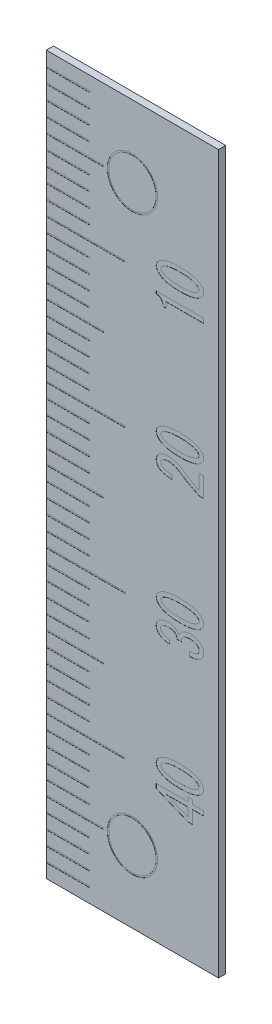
from build123d import *

# Parameters (mm, degrees)
SKETCH1_W      = 12
SKETCH1_H      = 50
EXTRUDE1_DEPTH = 0.5
SKETCH2_R      = 1.75
SKETCH2_R_2    = 1.65
EXTRUDE2_DEPTH = 0.01
EXTRUDE3_DEPTH = 0.01
SKETCH4_W      = 3
SKETCH4_H      = 0.1
SKETCH4_W_2    = 4
SKETCH4_W_3    = 5.5
EXTRUDE4_DEPTH = 0.01


with BuildPart() as part:
    # Sketch1 → Extrude1 (new body)
    with BuildSketch(Plane.XY):
        with Locations((6, 25)):
            Rectangle(SKETCH1_W, SKETCH1_H)
    extrude(amount=EXTRUDE1_DEPTH)

    # Sketch2 → Extrude2 (cut)
    # profile 1 of 2: a face of its own
    with BuildSketch(Plane.XY.offset(0.5)):
        with Locations((6, 5)):
            Circle(SKETCH2_R)
        with Locations((6, 5)):
            Circle(SKETCH2_R_2, mode=Mode.SUBTRACT)
    # profile 2 of 2: a face of its own
    with BuildSketch(Plane.XY.offset(0.5)):
        with Locations((6, 45)):
            Circle(SKETCH2_R)
        with Locations((6, 45)):
            Circle(SKETCH2_R_2, mode=Mode.SUBTRACT)
    extrude(amount=-EXTRUDE2_DEPTH, mode=Mode.SUBTRACT)

    # Sketch3 → Extrude3 (cut)
    # profile 1 of 8: a face of its own
    with BuildSketch(Plane.XY.offset(0.5)):
        with BuildLine():
            Line((10.964202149, 38.983541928), (9.643449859, 38.983541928))
            Line((9.643449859, 38.983541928), (8.334630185, 38.983541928))
            Line((8.334630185, 38.983541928), (8.334630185, 38.58788147))
            Line((8.334630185, 38.58788147), (8.134287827, 38.58788147))
            add(Edge.make_bspline(
                [(8.134287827, 38.58788147), (8.133949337, 38.607154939), (8.133292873, 38.644533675), (8.127537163, 38.699138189), (8.117992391, 38.750485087), (8.105914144, 38.79930573), (8.088535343, 38.844454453), (8.068559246, 38.887235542), (8.044100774, 38.926478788), (8.016032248, 38.962796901), (7.984633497, 38.996211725), (7.949221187, 39.026469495), (7.910057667, 39.053561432), (7.867120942, 39.077453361), (7.820438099, 39.09818504), (7.770182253, 39.115604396), (7.716225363, 39.130205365), (7.67880858, 39.137442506), (7.659495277, 39.141178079)],
                knots=[0, 0, 0, 0, 1.144858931, 2.220325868, 3.257124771, 4.246590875, 5.202985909, 6.126465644, 7.048017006, 7.94360395, 8.849836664, 9.767181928, 10.705616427, 11.674465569, 12.68221077, 13.736395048, 14.831602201, 16, 16, 16, 16], degree=3))
            Line((7.659495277, 39.141178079), (7.659495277, 39.303210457))
            Line((7.659495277, 39.303210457), (10.964202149, 39.303210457))
            Line((10.964202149, 39.303210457), (10.964202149, 38.983541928))
        make_face()
    # profile 2 of 8: a face of its own
    with BuildSketch(Plane.XY.offset(0.5)):
        with BuildLine():
            add(Edge.make_bspline(
                [(9.304312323, 40.08636695), (9.263487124, 40.086598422), (9.183284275, 40.087053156), (9.065184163, 40.090916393), (8.951677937, 40.097059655), (8.842790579, 40.105920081), (8.738418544, 40.116877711), (8.638826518, 40.131643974), (8.543659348, 40.147711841), (8.453367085, 40.166540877), (8.367534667, 40.187646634), (8.286660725, 40.212475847), (8.209981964, 40.238496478), (8.13792646, 40.267351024), (8.071052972, 40.299483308), (8.008231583, 40.333293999), (7.950513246, 40.370357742), (7.914537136, 40.397244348), (7.896891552, 40.410431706)],
                knots=[0, 0, 0, 0, 1.334199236, 2.621091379, 3.861325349, 5.048806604, 6.191184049, 7.29033474, 8.338632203, 9.344988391, 10.304094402, 11.226124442, 12.10888774, 12.949942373, 13.760906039, 14.53244093, 15.280190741, 16, 16, 16, 16], degree=3))
            add(Edge.make_bspline(
                [(7.896891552, 40.410431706), (7.877886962, 40.425936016), (7.841081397, 40.455962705), (7.793642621, 40.506288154), (7.75209867, 40.556343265), (7.718531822, 40.608467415), (7.691781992, 40.661574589), (7.673561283, 40.716630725), (7.661657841, 40.77250316), (7.660214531, 40.810429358), (7.659495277, 40.829329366)],
                knots=[0, 0, 0, 0, 1.179273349, 2.283859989, 3.322502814, 4.306324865, 5.261663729, 6.17616916, 7.091118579, 8, 8, 8, 8], degree=3))
            add(Edge.make_bspline(
                [(7.659495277, 40.829329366), (7.660212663, 40.848230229), (7.661652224, 40.886158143), (7.67358392, 40.942017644), (7.691636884, 40.996945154), (7.718688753, 41.049705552), (7.752296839, 41.101723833), (7.793217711, 41.152330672), (7.841340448, 41.202029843), (7.877935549, 41.232049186), (7.896891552, 41.247598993)],
                knots=[0, 0, 0, 0, 0.909839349, 1.825753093, 2.741222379, 3.688535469, 4.673394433, 5.720979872, 6.819483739, 8, 8, 8, 8], degree=3))
            add(Edge.make_bspline(
                [(7.896891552, 41.247598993), (7.914537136, 41.260786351), (7.950513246, 41.287672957), (8.008231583, 41.3247367), (8.071052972, 41.358547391), (8.13792646, 41.390679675), (8.209981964, 41.419534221), (8.286660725, 41.445554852), (8.367534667, 41.470384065), (8.453367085, 41.491489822), (8.543659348, 41.510318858), (8.638826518, 41.526386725), (8.738418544, 41.541152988), (8.842790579, 41.552110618), (8.951677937, 41.560971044), (9.065184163, 41.567114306), (9.183284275, 41.570977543), (9.263487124, 41.571432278), (9.304312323, 41.571663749)],
                knots=[0, 0, 0, 0, 0.719809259, 1.46755907, 2.239093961, 3.050057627, 3.89111226, 4.773875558, 5.695905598, 6.655011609, 7.661367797, 8.70966526, 9.808815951, 10.951193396, 12.138674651, 13.378908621, 14.665800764, 16, 16, 16, 16], degree=3))
            add(Edge.make_bspline(
                [(9.304312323, 41.571663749), (9.345974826, 41.571432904), (9.427642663, 41.570980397), (9.547627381, 41.567132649), (9.662805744, 41.560946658), (9.773365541, 41.552091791), (9.879218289, 41.541255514), (9.980042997, 41.52631378), (10.076267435, 41.510328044), (10.167806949, 41.49146689), (10.25471717, 41.470480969), (10.336402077, 41.445542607), (10.413707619, 41.419531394), (10.486394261, 41.390685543), (10.553875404, 41.358519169), (10.617234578, 41.324907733), (10.675058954, 41.28765614), (10.711041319, 41.260780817), (10.728689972, 41.247598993)],
                knots=[0, 0, 0, 0, 1.346341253, 2.639130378, 3.8790076, 5.073442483, 6.223226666, 7.316783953, 8.366697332, 9.375051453, 10.336565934, 11.254764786, 12.134057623, 12.971986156, 13.779994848, 14.548849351, 15.288238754, 16, 16, 16, 16], degree=3))
            add(Edge.make_bspline(
                [(10.728689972, 41.247598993), (10.747351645, 41.231964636), (10.783604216, 41.201592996), (10.832476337, 41.152791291), (10.872490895, 41.101447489), (10.906527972, 41.049937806), (10.932289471, 40.996615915), (10.951811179, 40.942259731), (10.962410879, 40.886054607), (10.964024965, 40.848209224), (10.964830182, 40.829329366)],
                knots=[0, 0, 0, 0, 1.1743338, 2.28128622, 3.323893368, 4.309986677, 5.254013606, 6.173907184, 7.08902033, 8, 8, 8, 8], degree=3))
            add(Edge.make_bspline(
                [(10.964830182, 40.829329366), (10.964023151, 40.81045032), (10.962405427, 40.772606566), (10.95183315, 40.716389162), (10.932141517, 40.661902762), (10.906685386, 40.608236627), (10.872691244, 40.556620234), (10.832051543, 40.505827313), (10.783860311, 40.456400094), (10.747399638, 40.426020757), (10.728689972, 40.410431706)],
                knots=[0, 0, 0, 0, 0.910025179, 1.824179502, 2.743109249, 3.69522398, 4.680284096, 5.713901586, 6.826896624, 8, 8, 8, 8], degree=3))
            add(Edge.make_bspline(
                [(10.728689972, 40.410431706), (10.711041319, 40.397249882), (10.675058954, 40.370374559), (10.617234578, 40.333122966), (10.553875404, 40.29951153), (10.486394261, 40.267345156), (10.413707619, 40.238499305), (10.336402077, 40.212488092), (10.25471717, 40.18754973), (10.167806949, 40.166563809), (10.076267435, 40.147702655), (9.980042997, 40.131716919), (9.879218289, 40.116775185), (9.773365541, 40.105938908), (9.662805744, 40.097084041), (9.547627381, 40.09089805), (9.427642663, 40.087050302), (9.345974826, 40.086597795), (9.304312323, 40.08636695)],
                knots=[0, 0, 0, 0, 0.711761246, 1.451150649, 2.220005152, 3.028013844, 3.865942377, 4.745235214, 5.663434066, 6.624948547, 7.633302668, 8.683216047, 9.776773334, 10.926557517, 12.1209924, 13.360869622, 14.653658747, 16, 16, 16, 16], degree=3))
        make_face()
        with BuildLine():
            add(Edge.make_bspline(
                [(9.304312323, 41.261415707), (9.267676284, 41.261069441), (9.195861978, 41.260390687), (9.090316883, 41.258165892), (8.989150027, 41.253278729), (8.892481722, 41.245290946), (8.80022693, 41.237179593), (8.712814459, 41.225295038), (8.629718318, 41.213328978), (8.551258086, 41.197943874), (8.47692929, 41.181420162), (8.407398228, 41.16150603), (8.341873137, 41.141413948), (8.281453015, 41.117852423), (8.225379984, 41.092883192), (8.173815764, 41.065786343), (8.126168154, 41.037204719), (8.097468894, 41.015283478), (8.083417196, 41.004550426)],
                knots=[0, 0, 0, 0, 1.387476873, 2.71974516, 3.997715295, 5.222316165, 6.392993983, 7.5041764, 8.562605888, 9.571696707, 10.531368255, 11.445041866, 12.310057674, 13.125709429, 13.899281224, 14.633331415, 15.330853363, 16, 16, 16, 16], degree=3))
            add(Edge.make_bspline(
                [(8.083417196, 41.004550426), (8.067942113, 40.991309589), (8.038992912, 40.966539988), (8.006840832, 40.922559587), (7.985224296, 40.87705391), (7.982844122, 40.845041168), (7.981675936, 40.829329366)],
                knots=[0, 0, 0, 0, 1.162721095, 2.175099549, 3.10434177, 4, 4, 4, 4], degree=3))
            add(Edge.make_bspline(
                [(7.981675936, 40.829329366), (7.982836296, 40.813611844), (7.985200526, 40.781587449), (8.007018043, 40.736019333), (8.038753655, 40.691521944), (8.067903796, 40.666693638), (8.083417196, 40.653480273)],
                knots=[0, 0, 0, 0, 0.893494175, 1.820491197, 2.840088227, 4, 4, 4, 4], degree=3))
            add(Edge.make_bspline(
                [(8.083417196, 40.653480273), (8.098156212, 40.643035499), (8.128454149, 40.621564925), (8.177291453, 40.592299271), (8.230299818, 40.565060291), (8.287887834, 40.540907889), (8.349363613, 40.517529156), (8.415145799, 40.496237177), (8.485227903, 40.477516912), (8.559390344, 40.460570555), (8.637959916, 40.445608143), (8.720652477, 40.432335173), (8.807623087, 40.421817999), (8.898748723, 40.413272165), (8.994176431, 40.405404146), (9.093874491, 40.400498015), (9.197746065, 40.398267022), (9.268304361, 40.397589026), (9.304312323, 40.397243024)],
                knots=[0, 0, 0, 0, 0.684573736, 1.407229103, 2.156074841, 2.941731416, 3.772993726, 4.648817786, 5.561264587, 6.521855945, 7.531913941, 8.592575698, 9.69595549, 10.851956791, 12.06190895, 13.325252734, 14.634998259, 16, 16, 16, 16], degree=3))
            add(Edge.make_bspline(
                [(9.304312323, 40.397243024), (9.341785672, 40.397588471), (9.415065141, 40.398263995), (9.522703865, 40.400490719), (9.625541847, 40.405385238), (9.723691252, 40.413273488), (9.817323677, 40.421841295), (9.906404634, 40.432229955), (9.990753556, 40.445635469), (10.070391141, 40.460491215), (10.145369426, 40.477539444), (10.215901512, 40.496147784), (10.281702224, 40.517419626), (10.342729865, 40.540898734), (10.399661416, 40.565104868), (10.451853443, 40.591966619), (10.49904188, 40.621590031), (10.528053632, 40.643045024), (10.542164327, 40.653480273)],
                knots=[0, 0, 0, 0, 1.401046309, 2.739758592, 4.0248449, 5.249399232, 6.420696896, 7.540008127, 8.601571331, 9.613140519, 10.568176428, 11.475655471, 12.339456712, 13.151990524, 13.919674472, 14.651282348, 15.344012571, 16, 16, 16, 16], degree=3))
            add(Edge.make_bspline(
                [(10.542164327, 40.653480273), (10.557596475, 40.666746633), (10.586687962, 40.691755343), (10.619429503, 40.735654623), (10.640196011, 40.781762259), (10.642682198, 40.813642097), (10.643905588, 40.829329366)],
                knots=[0, 0, 0, 0, 1.159232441, 2.18529495, 3.107029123, 4, 4, 4, 4], degree=3))
            add(Edge.make_bspline(
                [(10.643905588, 40.829329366), (10.642674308, 40.845010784), (10.640172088, 40.876878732), (10.619603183, 40.922925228), (10.586449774, 40.966304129), (10.557558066, 40.991255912), (10.542164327, 41.004550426)],
                knots=[0, 0, 0, 0, 0.89511734, 1.819067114, 2.837981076, 4, 4, 4, 4], degree=3))
            add(Edge.make_bspline(
                [(10.542164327, 41.004550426), (10.528109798, 41.015278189), (10.499404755, 41.037188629), (10.45164342, 41.065951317), (10.399548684, 41.092855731), (10.342868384, 41.117856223), (10.281814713, 41.14140776), (10.215668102, 41.161504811), (10.14550559, 41.181409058), (10.070358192, 41.198018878), (9.990830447, 41.213306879), (9.906283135, 41.225349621), (9.817389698, 41.237124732), (9.72367965, 41.245296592), (9.625545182, 41.253298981), (9.522702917, 41.258160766), (9.415065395, 41.26039668), (9.341785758, 41.261070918), (9.304312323, 41.261415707)],
                knots=[0, 0, 0, 0, 0.660466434, 1.348940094, 2.080407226, 2.851088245, 3.663465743, 4.524722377, 5.434082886, 6.388935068, 7.400309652, 8.46048529, 9.580538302, 10.751610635, 11.975929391, 13.260768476, 14.599223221, 16, 16, 16, 16], degree=3))
        make_face(mode=Mode.SUBTRACT)
    # profile 3 of 8: a face of its own
    with BuildSketch(Plane.XY.offset(0.5)):
        with BuildLine():
            Line((10.643905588, 29.789307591), (10.964830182, 29.789307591))
            Line((10.964830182, 29.789307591), (10.964830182, 28.412032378))
            Line((10.964830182, 28.412032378), (10.694776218, 28.412032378))
            add(Edge.make_bspline(
                [(10.694776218, 28.412032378), (10.634104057, 28.438239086), (10.512820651, 28.490626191), (10.333941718, 28.576059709), (10.15666089, 28.664824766), (9.982086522, 28.759401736), (9.809323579, 28.858008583), (9.638392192, 28.960822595), (9.469988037, 29.068963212), (9.359615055, 29.144268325), (9.304312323, 29.18200019)],
                knots=[0, 0, 0, 0, 0.99614483, 1.991289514, 2.987624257, 3.984438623, 4.983697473, 5.985971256, 6.990864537, 8, 8, 8, 8], degree=3))
            add(Edge.make_bspline(
                [(9.304312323, 29.18200019), (9.273407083, 29.202561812), (9.212458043, 29.24311193), (9.117211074, 29.295150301), (9.021104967, 29.339278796), (8.923672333, 29.375332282), (8.825440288, 29.4035815), (8.72593849, 29.42388529), (8.625513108, 29.436178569), (8.558034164, 29.437551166), (8.524295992, 29.438237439)],
                knots=[0, 0, 0, 0, 1.067918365, 2.106070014, 3.119789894, 4.109153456, 5.093164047, 6.058534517, 7.029304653, 8, 8, 8, 8], degree=3))
            add(Edge.make_bspline(
                [(8.524295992, 29.438237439), (8.501046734, 29.437894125), (8.455732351, 29.437224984), (8.389860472, 29.431518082), (8.328132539, 29.422267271), (8.270797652, 29.409104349), (8.21743613, 29.392320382), (8.168710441, 29.370724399), (8.123431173, 29.346637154), (8.096599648, 29.326782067), (8.083417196, 29.317027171)],
                knots=[0, 0, 0, 0, 1.197973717, 2.334932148, 3.404529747, 4.412096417, 5.3640046, 6.281988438, 7.155932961, 8, 8, 8, 8], degree=3))
            add(Edge.make_bspline(
                [(8.083417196, 29.317027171), (8.067746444, 29.303076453), (8.037248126, 29.275925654), (8.005254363, 29.223199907), (7.984772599, 29.164442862), (7.982726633, 29.122515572), (7.981675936, 29.100984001)],
                knots=[0, 0, 0, 0, 1.01321699, 1.971916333, 2.958486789, 4, 4, 4, 4], degree=3))
            add(Edge.make_bspline(
                [(7.981675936, 29.100984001), (7.983585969, 29.082717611), (7.987575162, 29.044567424), (8.01537348, 28.988943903), (8.059276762, 28.934674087), (8.097036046, 28.902326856), (8.11733095, 28.88494083)],
                knots=[0, 0, 0, 0, 0.831770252, 1.737190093, 2.783782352, 4, 4, 4, 4], degree=3))
            add(Edge.make_bspline(
                [(8.11733095, 28.88494083), (8.13152823, 28.875101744), (8.161915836, 28.854042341), (8.215884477, 28.829594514), (8.27953563, 28.808918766), (8.353234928, 28.792609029), (8.436819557, 28.778578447), (8.530630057, 28.769762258), (8.63433812, 28.764032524), (8.706835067, 28.763421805), (8.74473539, 28.76310253)],
                knots=[0, 0, 0, 0, 0.638255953, 1.36611168, 2.182006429, 3.11234378, 4.156826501, 5.317109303, 6.597424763, 8, 8, 8, 8], degree=3))
            Line((8.74473539, 28.76310253), (8.74473539, 28.466043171))
            add(Edge.make_bspline(
                [(8.74473539, 28.466043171), (8.695515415, 28.46790543), (8.600702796, 28.471492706), (8.463728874, 28.483794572), (8.337426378, 28.503038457), (8.221668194, 28.528812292), (8.116016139, 28.559516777), (8.021404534, 28.598268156), (7.936291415, 28.64179784), (7.886844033, 28.67828985), (7.862977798, 28.695903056)],
                knots=[0, 0, 0, 0, 1.276449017, 2.458828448, 3.562299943, 4.585123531, 5.530965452, 6.409552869, 7.23235602, 8, 8, 8, 8], degree=3))
            add(Edge.make_bspline(
                [(7.862977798, 28.695903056), (7.846729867, 28.709564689), (7.814699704, 28.736496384), (7.773183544, 28.782576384), (7.738532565, 28.832204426), (7.708926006, 28.884437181), (7.687412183, 28.940944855), (7.67065538, 29.000105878), (7.661233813, 29.063001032), (7.660084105, 29.105978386), (7.659495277, 29.127989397)],
                knots=[0, 0, 0, 0, 1.027969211, 2.026474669, 2.994832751, 3.957646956, 4.927969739, 5.917517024, 6.933448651, 8, 8, 8, 8], degree=3))
            add(Edge.make_bspline(
                [(7.659495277, 29.127989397), (7.659956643, 29.148979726), (7.660867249, 29.190408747), (7.672379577, 29.250967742), (7.688861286, 29.309450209), (7.71397118, 29.364787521), (7.74481477, 29.418042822), (7.782906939, 29.468678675), (7.828294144, 29.516390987), (7.862484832, 29.545314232), (7.879934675, 29.560075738)],
                knots=[0, 0, 0, 0, 1.000230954, 1.974175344, 2.932001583, 3.893571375, 4.865053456, 5.864036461, 6.909871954, 8, 8, 8, 8], degree=3))
            add(Edge.make_bspline(
                [(7.879934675, 29.560075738), (7.900321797, 29.575446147), (7.941611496, 29.606575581), (8.010569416, 29.644342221), (8.084899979, 29.676515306), (8.164800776, 29.703727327), (8.25083857, 29.724143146), (8.34261768, 29.738396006), (8.43996472, 29.747294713), (8.506900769, 29.748496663), (8.541252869, 29.749113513)],
                knots=[0, 0, 0, 0, 0.873404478, 1.768891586, 2.683909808, 3.645167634, 4.655436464, 5.707963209, 6.823708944, 8, 8, 8, 8], degree=3))
            add(Edge.make_bspline(
                [(8.541252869, 29.749113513), (8.5825466, 29.747997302), (8.665684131, 29.745750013), (8.7908176, 29.728176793), (8.916613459, 29.69873904), (9.043909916, 29.659401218), (9.171696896, 29.607206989), (9.300597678, 29.544064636), (9.430892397, 29.470149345), (9.515481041, 29.41326659), (9.558665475, 29.384226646)],
                knots=[0, 0, 0, 0, 0.902713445, 1.817451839, 2.756860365, 3.725448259, 4.727634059, 5.771721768, 6.862413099, 8, 8, 8, 8], degree=3))
            add(Edge.make_bspline(
                [(9.558665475, 29.384226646), (9.650692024, 29.32107194), (9.831341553, 29.197098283), (10.105692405, 29.027797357), (10.37414261, 28.87223849), (10.555117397, 28.780905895), (10.643905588, 28.736097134)],
                knots=[0, 0, 0, 0, 1.058433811, 2.077721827, 3.056909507, 4, 4, 4, 4], degree=3))
            Line((10.643905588, 28.736097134), (10.643905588, 29.789307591))
        make_face()
    # profile 4 of 8: a face of its own
    with BuildSketch(Plane.XY.offset(0.5)):
        with BuildLine():
            add(Edge.make_bspline(
                [(9.304312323, 30.08636695), (9.263487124, 30.086598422), (9.183284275, 30.087053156), (9.065184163, 30.090916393), (8.951677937, 30.097059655), (8.842790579, 30.105920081), (8.738418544, 30.116877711), (8.638826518, 30.131643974), (8.543659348, 30.147711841), (8.453367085, 30.166540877), (8.367534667, 30.187646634), (8.286660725, 30.212475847), (8.209981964, 30.238496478), (8.13792646, 30.267351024), (8.071052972, 30.299483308), (8.008231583, 30.333293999), (7.950513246, 30.370357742), (7.914537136, 30.397244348), (7.896891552, 30.410431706)],
                knots=[0, 0, 0, 0, 1.334199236, 2.621091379, 3.861325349, 5.048806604, 6.191184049, 7.29033474, 8.338632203, 9.344988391, 10.304094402, 11.226124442, 12.10888774, 12.949942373, 13.760906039, 14.53244093, 15.280190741, 16, 16, 16, 16], degree=3))
            add(Edge.make_bspline(
                [(7.896891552, 30.410431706), (7.877886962, 30.425936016), (7.841081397, 30.455962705), (7.793642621, 30.506288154), (7.75209867, 30.556343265), (7.718531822, 30.608467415), (7.691781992, 30.661574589), (7.673561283, 30.716630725), (7.661657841, 30.77250316), (7.660214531, 30.810429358), (7.659495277, 30.829329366)],
                knots=[0, 0, 0, 0, 1.179273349, 2.283859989, 3.322502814, 4.306324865, 5.261663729, 6.17616916, 7.091118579, 8, 8, 8, 8], degree=3))
            add(Edge.make_bspline(
                [(7.659495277, 30.829329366), (7.660212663, 30.848230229), (7.661652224, 30.886158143), (7.67358392, 30.942017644), (7.691636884, 30.996945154), (7.718688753, 31.049705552), (7.752296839, 31.101723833), (7.793217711, 31.152330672), (7.841340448, 31.202029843), (7.877935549, 31.232049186), (7.896891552, 31.247598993)],
                knots=[0, 0, 0, 0, 0.909839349, 1.825753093, 2.741222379, 3.688535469, 4.673394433, 5.720979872, 6.819483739, 8, 8, 8, 8], degree=3))
            add(Edge.make_bspline(
                [(7.896891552, 31.247598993), (7.914537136, 31.260786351), (7.950513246, 31.287672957), (8.008231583, 31.3247367), (8.071052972, 31.358547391), (8.13792646, 31.390679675), (8.209981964, 31.419534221), (8.286660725, 31.445554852), (8.367534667, 31.470384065), (8.453367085, 31.491489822), (8.543659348, 31.510318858), (8.638826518, 31.526386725), (8.738418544, 31.541152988), (8.842790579, 31.552110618), (8.951677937, 31.560971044), (9.065184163, 31.567114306), (9.183284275, 31.570977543), (9.263487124, 31.571432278), (9.304312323, 31.571663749)],
                knots=[0, 0, 0, 0, 0.719809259, 1.46755907, 2.239093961, 3.050057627, 3.89111226, 4.773875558, 5.695905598, 6.655011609, 7.661367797, 8.70966526, 9.808815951, 10.951193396, 12.138674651, 13.378908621, 14.665800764, 16, 16, 16, 16], degree=3))
            add(Edge.make_bspline(
                [(9.304312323, 31.571663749), (9.345974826, 31.571432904), (9.427642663, 31.570980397), (9.547627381, 31.567132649), (9.662805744, 31.560946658), (9.773365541, 31.552091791), (9.879218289, 31.541255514), (9.980042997, 31.52631378), (10.076267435, 31.510328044), (10.167806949, 31.49146689), (10.25471717, 31.470480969), (10.336402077, 31.445542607), (10.413707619, 31.419531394), (10.486394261, 31.390685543), (10.553875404, 31.358519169), (10.617234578, 31.324907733), (10.675058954, 31.28765614), (10.711041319, 31.260780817), (10.728689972, 31.247598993)],
                knots=[0, 0, 0, 0, 1.346341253, 2.639130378, 3.8790076, 5.073442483, 6.223226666, 7.316783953, 8.366697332, 9.375051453, 10.336565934, 11.254764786, 12.134057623, 12.971986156, 13.779994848, 14.548849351, 15.288238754, 16, 16, 16, 16], degree=3))
            add(Edge.make_bspline(
                [(10.728689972, 31.247598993), (10.747351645, 31.231964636), (10.783604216, 31.201592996), (10.832476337, 31.152791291), (10.872490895, 31.101447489), (10.906527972, 31.049937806), (10.932289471, 30.996615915), (10.951811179, 30.942259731), (10.962410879, 30.886054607), (10.964024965, 30.848209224), (10.964830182, 30.829329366)],
                knots=[0, 0, 0, 0, 1.1743338, 2.28128622, 3.323893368, 4.309986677, 5.254013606, 6.173907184, 7.08902033, 8, 8, 8, 8], degree=3))
            add(Edge.make_bspline(
                [(10.964830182, 30.829329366), (10.964023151, 30.81045032), (10.962405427, 30.772606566), (10.95183315, 30.716389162), (10.932141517, 30.661902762), (10.906685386, 30.608236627), (10.872691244, 30.556620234), (10.832051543, 30.505827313), (10.783860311, 30.456400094), (10.747399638, 30.426020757), (10.728689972, 30.410431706)],
                knots=[0, 0, 0, 0, 0.910025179, 1.824179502, 2.743109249, 3.69522398, 4.680284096, 5.713901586, 6.826896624, 8, 8, 8, 8], degree=3))
            add(Edge.make_bspline(
                [(10.728689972, 30.410431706), (10.711041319, 30.397249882), (10.675058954, 30.370374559), (10.617234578, 30.333122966), (10.553875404, 30.29951153), (10.486394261, 30.267345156), (10.413707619, 30.238499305), (10.336402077, 30.212488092), (10.25471717, 30.18754973), (10.167806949, 30.166563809), (10.076267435, 30.147702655), (9.980042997, 30.131716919), (9.879218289, 30.116775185), (9.773365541, 30.105938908), (9.662805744, 30.097084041), (9.547627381, 30.09089805), (9.427642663, 30.087050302), (9.345974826, 30.086597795), (9.304312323, 30.08636695)],
                knots=[0, 0, 0, 0, 0.711761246, 1.451150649, 2.220005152, 3.028013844, 3.865942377, 4.745235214, 5.663434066, 6.624948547, 7.633302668, 8.683216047, 9.776773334, 10.926557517, 12.1209924, 13.360869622, 14.653658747, 16, 16, 16, 16], degree=3))
        make_face()
        with BuildLine():
            add(Edge.make_bspline(
                [(9.304312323, 31.261415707), (9.267676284, 31.261069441), (9.195861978, 31.260390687), (9.090316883, 31.258165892), (8.989150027, 31.253278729), (8.892481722, 31.245290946), (8.80022693, 31.237179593), (8.712814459, 31.225295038), (8.629718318, 31.213328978), (8.551258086, 31.197943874), (8.47692929, 31.181420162), (8.407398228, 31.16150603), (8.341873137, 31.141413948), (8.281453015, 31.117852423), (8.225379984, 31.092883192), (8.173815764, 31.065786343), (8.126168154, 31.037204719), (8.097468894, 31.015283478), (8.083417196, 31.004550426)],
                knots=[0, 0, 0, 0, 1.387476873, 2.71974516, 3.997715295, 5.222316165, 6.392993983, 7.5041764, 8.562605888, 9.571696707, 10.531368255, 11.445041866, 12.310057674, 13.125709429, 13.899281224, 14.633331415, 15.330853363, 16, 16, 16, 16], degree=3))
            add(Edge.make_bspline(
                [(8.083417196, 31.004550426), (8.067942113, 30.991309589), (8.038992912, 30.966539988), (8.006840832, 30.922559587), (7.985224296, 30.87705391), (7.982844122, 30.845041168), (7.981675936, 30.829329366)],
                knots=[0, 0, 0, 0, 1.162721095, 2.175099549, 3.10434177, 4, 4, 4, 4], degree=3))
            add(Edge.make_bspline(
                [(7.981675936, 30.829329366), (7.982836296, 30.813611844), (7.985200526, 30.781587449), (8.007018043, 30.736019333), (8.038753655, 30.691521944), (8.067903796, 30.666693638), (8.083417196, 30.653480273)],
                knots=[0, 0, 0, 0, 0.893494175, 1.820491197, 2.840088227, 4, 4, 4, 4], degree=3))
            add(Edge.make_bspline(
                [(8.083417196, 30.653480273), (8.098156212, 30.643035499), (8.128454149, 30.621564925), (8.177291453, 30.592299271), (8.230299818, 30.565060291), (8.287887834, 30.540907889), (8.349363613, 30.517529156), (8.415145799, 30.496237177), (8.485227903, 30.477516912), (8.559390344, 30.460570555), (8.637959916, 30.445608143), (8.720652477, 30.432335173), (8.807623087, 30.421817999), (8.898748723, 30.413272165), (8.994176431, 30.405404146), (9.093874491, 30.400498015), (9.197746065, 30.398267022), (9.268304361, 30.397589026), (9.304312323, 30.397243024)],
                knots=[0, 0, 0, 0, 0.684573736, 1.407229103, 2.156074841, 2.941731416, 3.772993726, 4.648817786, 5.561264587, 6.521855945, 7.531913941, 8.592575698, 9.69595549, 10.851956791, 12.06190895, 13.325252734, 14.634998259, 16, 16, 16, 16], degree=3))
            add(Edge.make_bspline(
                [(9.304312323, 30.397243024), (9.341785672, 30.397588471), (9.415065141, 30.398263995), (9.522703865, 30.400490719), (9.625541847, 30.405385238), (9.723691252, 30.413273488), (9.817323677, 30.421841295), (9.906404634, 30.432229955), (9.990753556, 30.445635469), (10.070391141, 30.460491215), (10.145369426, 30.477539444), (10.215901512, 30.496147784), (10.281702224, 30.517419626), (10.342729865, 30.540898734), (10.399661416, 30.565104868), (10.451853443, 30.591966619), (10.49904188, 30.621590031), (10.528053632, 30.643045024), (10.542164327, 30.653480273)],
                knots=[0, 0, 0, 0, 1.401046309, 2.739758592, 4.0248449, 5.249399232, 6.420696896, 7.540008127, 8.601571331, 9.613140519, 10.568176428, 11.475655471, 12.339456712, 13.151990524, 13.919674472, 14.651282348, 15.344012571, 16, 16, 16, 16], degree=3))
            add(Edge.make_bspline(
                [(10.542164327, 30.653480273), (10.557596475, 30.666746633), (10.586687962, 30.691755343), (10.619429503, 30.735654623), (10.640196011, 30.781762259), (10.642682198, 30.813642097), (10.643905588, 30.829329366)],
                knots=[0, 0, 0, 0, 1.159232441, 2.18529495, 3.107029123, 4, 4, 4, 4], degree=3))
            add(Edge.make_bspline(
                [(10.643905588, 30.829329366), (10.642674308, 30.845010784), (10.640172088, 30.876878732), (10.619603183, 30.922925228), (10.586449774, 30.966304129), (10.557558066, 30.991255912), (10.542164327, 31.004550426)],
                knots=[0, 0, 0, 0, 0.89511734, 1.819067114, 2.837981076, 4, 4, 4, 4], degree=3))
            add(Edge.make_bspline(
                [(10.542164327, 31.004550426), (10.528109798, 31.015278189), (10.499404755, 31.037188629), (10.45164342, 31.065951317), (10.399548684, 31.092855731), (10.342868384, 31.117856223), (10.281814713, 31.14140776), (10.215668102, 31.161504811), (10.14550559, 31.181409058), (10.070358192, 31.198018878), (9.990830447, 31.213306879), (9.906283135, 31.225349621), (9.817389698, 31.237124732), (9.72367965, 31.245296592), (9.625545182, 31.253298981), (9.522702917, 31.258160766), (9.415065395, 31.26039668), (9.341785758, 31.261070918), (9.304312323, 31.261415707)],
                knots=[0, 0, 0, 0, 0.660466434, 1.348940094, 2.080407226, 2.851088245, 3.663465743, 4.524722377, 5.434082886, 6.388935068, 7.400309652, 8.46048529, 9.580538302, 10.751610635, 11.975929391, 13.260768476, 14.599223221, 16, 16, 16, 16], degree=3))
        make_face(mode=Mode.SUBTRACT)
    # profile 5 of 8: a face of its own
    with BuildSketch(Plane.XY.offset(0.5)):
        with BuildLine():
            add(Edge.make_bspline(
                [(9.982587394, 18.709091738), (10.012525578, 18.708287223), (10.070543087, 18.706728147), (10.154420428, 18.710760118), (10.232130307, 18.718455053), (10.303298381, 18.73168567), (10.368273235, 18.749141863), (10.427053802, 18.770782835), (10.479378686, 18.79791141), (10.510164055, 18.820091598), (10.525207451, 18.830930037)],
                knots=[0, 0, 0, 0, 1.267087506, 2.455501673, 3.55133733, 4.569646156, 5.515332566, 6.395721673, 7.21606285, 8, 8, 8, 8], degree=3))
            add(Edge.make_bspline(
                [(10.525207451, 18.830930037), (10.543506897, 18.847280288), (10.579345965, 18.8793019), (10.617183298, 18.941459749), (10.639871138, 19.011713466), (10.642530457, 19.061449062), (10.643905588, 19.087167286)],
                knots=[0, 0, 0, 0, 1.002413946, 1.963205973, 2.946775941, 4, 4, 4, 4], degree=3))
            add(Edge.make_bspline(
                [(10.643905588, 19.087167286), (10.64205895, 19.10966892), (10.638250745, 19.15607263), (10.60631016, 19.222801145), (10.557507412, 19.287350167), (10.514319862, 19.324320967), (10.491293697, 19.344032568)],
                knots=[0, 0, 0, 0, 0.87119639, 1.796613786, 2.82522778, 4, 4, 4, 4], degree=3))
            add(Edge.make_bspline(
                [(10.491293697, 19.344032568), (10.477715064, 19.35383947), (10.449615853, 19.374133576), (10.40102721, 19.398039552), (10.347048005, 19.41973801), (10.286272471, 19.436247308), (10.219328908, 19.449449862), (10.146079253, 19.458528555), (10.066417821, 19.464292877), (10.011278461, 19.464917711), (9.982587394, 19.465242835)],
                knots=[0, 0, 0, 0, 0.754595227, 1.561536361, 2.43511806, 3.377163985, 4.397951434, 5.512234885, 6.705522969, 8, 8, 8, 8], degree=3))
            add(Edge.make_bspline(
                [(9.982587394, 19.465242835), (9.960377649, 19.46473344), (9.916687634, 19.463731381), (9.85267071, 19.456647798), (9.791236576, 19.44559945), (9.732735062, 19.428991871), (9.676430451, 19.40846888), (9.623062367, 19.382368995), (9.571883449, 19.352579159), (9.540443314, 19.328863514), (9.524751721, 19.317027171)],
                knots=[0, 0, 0, 0, 1.086352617, 2.137024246, 3.147391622, 4.136355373, 5.10847195, 6.074961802, 7.039224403, 8, 8, 8, 8], degree=3))
            add(Edge.make_bspline(
                [(9.524751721, 19.317027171), (9.514022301, 19.307663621), (9.492758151, 19.289106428), (9.465670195, 19.256771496), (9.44319759, 19.221167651), (9.426529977, 19.181802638), (9.413593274, 19.139332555), (9.406578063, 19.093273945), (9.403067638, 19.044064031), (9.405038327, 19.010337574), (9.406053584, 18.992962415)],
                knots=[0, 0, 0, 0, 0.947861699, 1.87852391, 2.799832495, 3.743268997, 4.71875736, 5.750864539, 6.841292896, 8, 8, 8, 8], degree=3))
            Line((9.406053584, 18.992962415), (9.117786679, 18.992962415))
            add(Edge.make_bspline(
                [(9.117786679, 18.992962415), (9.115917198, 19.01036469), (9.11227151, 19.044300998), (9.103170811, 19.09366086), (9.089082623, 19.139312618), (9.072365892, 19.182135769), (9.050836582, 19.220887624), (9.026138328, 19.256550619), (8.997813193, 19.288974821), (8.976089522, 19.307646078), (8.965174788, 19.317027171)],
                knots=[0, 0, 0, 0, 1.139052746, 2.221275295, 3.260086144, 4.244297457, 5.207730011, 6.137529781, 7.064229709, 8, 8, 8, 8], degree=3))
            add(Edge.make_bspline(
                [(8.965174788, 19.317027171), (8.953430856, 19.325692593), (8.929384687, 19.343435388), (8.888683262, 19.365118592), (8.844024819, 19.38418922), (8.794826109, 19.398815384), (8.741812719, 19.411043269), (8.684417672, 19.41879032), (8.62278159, 19.423939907), (8.580202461, 19.42467109), (8.558209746, 19.425048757)],
                knots=[0, 0, 0, 0, 0.816014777, 1.670822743, 2.574059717, 3.530392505, 4.539613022, 5.616822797, 6.769055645, 8, 8, 8, 8], degree=3))
            add(Edge.make_bspline(
                [(8.558209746, 19.425048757), (8.530985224, 19.424710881), (8.478357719, 19.424057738), (8.402231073, 19.418395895), (8.331762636, 19.409047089), (8.266898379, 19.396390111), (8.208285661, 19.3784051), (8.154956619, 19.358063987), (8.10766056, 19.33316966), (8.079858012, 19.312952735), (8.06646032, 19.303210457)],
                knots=[0, 0, 0, 0, 1.267211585, 2.44963652, 3.550842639, 4.575246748, 5.5217347, 6.401234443, 7.229575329, 8, 8, 8, 8], degree=3))
            add(Edge.make_bspline(
                [(8.06646032, 19.303210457), (8.050800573, 19.289680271), (8.020516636, 19.263514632), (7.989112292, 19.21338768), (7.967772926, 19.159180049), (7.965751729, 19.120663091), (7.964719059, 19.100984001)],
                knots=[0, 0, 0, 0, 1.053722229, 2.037763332, 2.997453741, 4, 4, 4, 4], degree=3))
            add(Edge.make_bspline(
                [(7.964719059, 19.100984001), (7.965793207, 19.081323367), (7.967906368, 19.0426452), (7.988749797, 18.988170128), (8.020925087, 18.938367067), (8.050860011, 18.911914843), (8.06646032, 18.898129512)],
                knots=[0, 0, 0, 0, 1.000412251, 1.968100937, 2.94109465, 4, 4, 4, 4], degree=3))
            add(Edge.make_bspline(
                [(8.06646032, 18.898129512), (8.081277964, 18.887055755), (8.111428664, 18.864523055), (8.162612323, 18.837488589), (8.218046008, 18.812216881), (8.279698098, 18.793150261), (8.345928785, 18.775455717), (8.417710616, 18.763754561), (8.494531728, 18.75366975), (8.547707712, 18.75119286), (8.575166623, 18.749913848)],
                knots=[0, 0, 0, 0, 0.823448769, 1.675540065, 2.573857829, 3.535986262, 4.547798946, 5.627975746, 6.775138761, 8, 8, 8, 8], degree=3))
            Line((8.575166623, 18.749913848), (8.575166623, 18.452854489))
            add(Edge.make_bspline(
                [(8.575166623, 18.452854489), (8.539320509, 18.454383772), (8.469081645, 18.457380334), (8.36662153, 18.471341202), (8.269148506, 18.489228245), (8.177509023, 18.515831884), (8.090488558, 18.54647123), (8.009243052, 18.585395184), (7.932662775, 18.629471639), (7.886090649, 18.664635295), (7.862977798, 18.682086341)],
                knots=[0, 0, 0, 0, 1.130465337, 2.215096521, 3.257023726, 4.251490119, 5.220175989, 6.161913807, 7.087793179, 8, 8, 8, 8], degree=3))
            add(Edge.make_bspline(
                [(7.862977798, 18.682086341), (7.8467956, 18.695809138), (7.81513049, 18.722661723), (7.772968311, 18.767477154), (7.738724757, 18.816404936), (7.709237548, 18.867139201), (7.68725208, 18.92158891), (7.670766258, 18.978543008), (7.661240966, 19.038909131), (7.660084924, 19.080016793), (7.659495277, 19.100984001)],
                knots=[0, 0, 0, 0, 1.054146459, 2.062739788, 3.04727221, 4.0164563, 4.972878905, 5.957576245, 6.958249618, 8, 8, 8, 8], degree=3))
            add(Edge.make_bspline(
                [(7.659495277, 19.100984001), (7.660084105, 19.122995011), (7.661233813, 19.165972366), (7.67065538, 19.228867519), (7.687412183, 19.288028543), (7.708926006, 19.344536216), (7.738532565, 19.396768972), (7.773183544, 19.446397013), (7.814699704, 19.492477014), (7.846729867, 19.519408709), (7.862977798, 19.533070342)],
                knots=[0, 0, 0, 0, 1.066551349, 2.082482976, 3.072030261, 4.042353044, 5.005167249, 5.973525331, 6.972030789, 8, 8, 8, 8], degree=3))
            add(Edge.make_bspline(
                [(7.862977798, 19.533070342), (7.883180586, 19.548391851), (7.923800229, 19.579197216), (7.99101211, 19.617407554), (8.063031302, 19.649133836), (8.139054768, 19.676462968), (8.220201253, 19.697274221), (8.306188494, 19.711237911), (8.396823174, 19.720285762), (8.458748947, 19.721491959), (8.490382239, 19.722108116)],
                knots=[0, 0, 0, 0, 0.910342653, 1.830331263, 2.769796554, 3.735781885, 4.730142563, 5.775142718, 6.863485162, 8, 8, 8, 8], degree=3))
            add(Edge.make_bspline(
                [(8.490382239, 19.722108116), (8.519286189, 19.72161156), (8.575295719, 19.720649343), (8.656472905, 19.713669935), (8.732474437, 19.70249683), (8.803229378, 19.686672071), (8.868446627, 19.664650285), (8.928974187, 19.640082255), (8.984286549, 19.610093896), (9.016949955, 19.585400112), (9.033002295, 19.57326442)],
                knots=[0, 0, 0, 0, 1.210143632, 2.344993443, 3.40861805, 4.424997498, 5.37575867, 6.287368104, 7.158331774, 8, 8, 8, 8], degree=3))
            add(Edge.make_bspline(
                [(9.033002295, 19.57326442), (9.059175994, 19.551536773), (9.108490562, 19.51059913), (9.171793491, 19.445781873), (9.221317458, 19.38266922), (9.243208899, 19.337936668), (9.253441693, 19.317027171)],
                knots=[0, 0, 0, 0, 1.195517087, 2.252505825, 3.183162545, 4, 4, 4, 4], degree=3))
            add(Edge.make_bspline(
                [(9.253441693, 19.317027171), (9.265088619, 19.34500906), (9.287538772, 19.398945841), (9.331763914, 19.47199791), (9.381380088, 19.535717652), (9.420772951, 19.570253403), (9.439967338, 19.587081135)],
                knots=[0, 0, 0, 0, 1.094399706, 2.109521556, 3.078854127, 4, 4, 4, 4], degree=3))
            add(Edge.make_bspline(
                [(9.439967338, 19.587081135), (9.459994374, 19.60234586), (9.499821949, 19.632702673), (9.564355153, 19.670989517), (9.632227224, 19.703077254), (9.702874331, 19.730156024), (9.776856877, 19.751027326), (9.854027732, 19.765256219), (9.934226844, 19.774233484), (9.988843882, 19.775485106), (10.016501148, 19.776118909)],
                knots=[0, 0, 0, 0, 0.976244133, 1.941447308, 2.904084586, 3.885987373, 4.873249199, 5.881498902, 6.927222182, 8, 8, 8, 8], degree=3))
            add(Edge.make_bspline(
                [(10.016501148, 19.776118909), (10.052324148, 19.77559206), (10.122443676, 19.774560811), (10.225084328, 19.764261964), (10.322576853, 19.747624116), (10.414506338, 19.72361205), (10.501245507, 19.69357359), (10.582537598, 19.656250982), (10.659144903, 19.612707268), (10.705595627, 19.577553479), (10.728689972, 19.560075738)],
                knots=[0, 0, 0, 0, 1.13285732, 2.217441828, 3.259318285, 4.258350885, 5.219645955, 6.158999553, 7.084692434, 8, 8, 8, 8], degree=3))
            add(Edge.make_bspline(
                [(10.728689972, 19.560075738), (10.747408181, 19.544073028), (10.784031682, 19.512762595), (10.832853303, 19.461250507), (10.873280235, 19.40591535), (10.906871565, 19.348128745), (10.932721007, 19.287091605), (10.951971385, 19.223397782), (10.962541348, 19.156184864), (10.964058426, 19.110438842), (10.964830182, 19.087167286)],
                knots=[0, 0, 0, 0, 1.078182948, 2.109541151, 3.099814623, 4.073306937, 5.030426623, 5.996463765, 6.980776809, 8, 8, 8, 8], degree=3))
            add(Edge.make_bspline(
                [(10.964830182, 19.087167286), (10.964367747, 19.062001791), (10.963461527, 19.012685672), (10.952274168, 18.941195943), (10.935512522, 18.873719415), (10.911441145, 18.810497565), (10.88066456, 18.751121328), (10.842591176, 18.696168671), (10.797876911, 18.645289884), (10.763207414, 18.615937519), (10.745646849, 18.601070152)],
                knots=[0, 0, 0, 0, 1.091653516, 2.139282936, 3.133504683, 4.105839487, 5.069340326, 6.029921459, 7.002128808, 8, 8, 8, 8], degree=3))
            add(Edge.make_bspline(
                [(10.745646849, 18.601070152), (10.723356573, 18.584883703), (10.677849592, 18.551838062), (10.601818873, 18.510403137), (10.51783525, 18.476087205), (10.426096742, 18.448030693), (10.326687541, 18.425207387), (10.21890008, 18.410072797), (10.103344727, 18.400491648), (10.023639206, 18.399403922), (9.982587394, 18.398843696)],
                knots=[0, 0, 0, 0, 0.821972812, 1.678108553, 2.577822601, 3.526913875, 4.539938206, 5.620279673, 6.774340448, 8, 8, 8, 8], degree=3))
            Line((9.982587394, 18.398843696), (9.982587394, 18.709091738))
        make_face()
    # profile 6 of 8: a face of its own
    with BuildSketch(Plane.XY.offset(0.5)):
        with BuildLine():
            add(Edge.make_bspline(
                [(9.304312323, 20.08636695), (9.263487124, 20.086598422), (9.183284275, 20.087053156), (9.065184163, 20.090916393), (8.951677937, 20.097059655), (8.842790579, 20.105920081), (8.738418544, 20.116877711), (8.638826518, 20.131643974), (8.543659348, 20.147711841), (8.453367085, 20.166540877), (8.367534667, 20.187646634), (8.286660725, 20.212475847), (8.209981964, 20.238496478), (8.13792646, 20.267351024), (8.071052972, 20.299483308), (8.008231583, 20.333293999), (7.950513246, 20.370357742), (7.914537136, 20.397244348), (7.896891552, 20.410431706)],
                knots=[0, 0, 0, 0, 1.334199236, 2.621091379, 3.861325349, 5.048806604, 6.191184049, 7.29033474, 8.338632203, 9.344988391, 10.304094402, 11.226124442, 12.10888774, 12.949942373, 13.760906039, 14.53244093, 15.280190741, 16, 16, 16, 16], degree=3))
            add(Edge.make_bspline(
                [(7.896891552, 20.410431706), (7.877886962, 20.425936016), (7.841081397, 20.455962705), (7.793642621, 20.506288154), (7.75209867, 20.556343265), (7.718531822, 20.608467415), (7.691781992, 20.661574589), (7.673561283, 20.716630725), (7.661657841, 20.77250316), (7.660214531, 20.810429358), (7.659495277, 20.829329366)],
                knots=[0, 0, 0, 0, 1.179273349, 2.283859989, 3.322502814, 4.306324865, 5.261663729, 6.17616916, 7.091118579, 8, 8, 8, 8], degree=3))
            add(Edge.make_bspline(
                [(7.659495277, 20.829329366), (7.660212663, 20.848230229), (7.661652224, 20.886158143), (7.67358392, 20.942017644), (7.691636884, 20.996945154), (7.718688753, 21.049705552), (7.752296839, 21.101723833), (7.793217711, 21.152330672), (7.841340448, 21.202029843), (7.877935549, 21.232049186), (7.896891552, 21.247598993)],
                knots=[0, 0, 0, 0, 0.909839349, 1.825753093, 2.741222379, 3.688535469, 4.673394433, 5.720979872, 6.819483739, 8, 8, 8, 8], degree=3))
            add(Edge.make_bspline(
                [(7.896891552, 21.247598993), (7.914537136, 21.260786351), (7.950513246, 21.287672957), (8.008231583, 21.3247367), (8.071052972, 21.358547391), (8.13792646, 21.390679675), (8.209981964, 21.419534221), (8.286660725, 21.445554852), (8.367534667, 21.470384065), (8.453367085, 21.491489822), (8.543659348, 21.510318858), (8.638826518, 21.526386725), (8.738418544, 21.541152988), (8.842790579, 21.552110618), (8.951677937, 21.560971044), (9.065184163, 21.567114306), (9.183284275, 21.570977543), (9.263487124, 21.571432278), (9.304312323, 21.571663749)],
                knots=[0, 0, 0, 0, 0.719809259, 1.46755907, 2.239093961, 3.050057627, 3.89111226, 4.773875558, 5.695905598, 6.655011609, 7.661367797, 8.70966526, 9.808815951, 10.951193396, 12.138674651, 13.378908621, 14.665800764, 16, 16, 16, 16], degree=3))
            add(Edge.make_bspline(
                [(9.304312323, 21.571663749), (9.345974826, 21.571432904), (9.427642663, 21.570980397), (9.547627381, 21.567132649), (9.662805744, 21.560946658), (9.773365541, 21.552091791), (9.879218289, 21.541255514), (9.980042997, 21.52631378), (10.076267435, 21.510328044), (10.167806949, 21.49146689), (10.25471717, 21.470480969), (10.336402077, 21.445542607), (10.413707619, 21.419531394), (10.486394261, 21.390685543), (10.553875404, 21.358519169), (10.617234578, 21.324907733), (10.675058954, 21.28765614), (10.711041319, 21.260780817), (10.728689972, 21.247598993)],
                knots=[0, 0, 0, 0, 1.346341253, 2.639130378, 3.8790076, 5.073442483, 6.223226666, 7.316783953, 8.366697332, 9.375051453, 10.336565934, 11.254764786, 12.134057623, 12.971986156, 13.779994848, 14.548849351, 15.288238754, 16, 16, 16, 16], degree=3))
            add(Edge.make_bspline(
                [(10.728689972, 21.247598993), (10.747351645, 21.231964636), (10.783604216, 21.201592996), (10.832476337, 21.152791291), (10.872490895, 21.101447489), (10.906527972, 21.049937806), (10.932289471, 20.996615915), (10.951811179, 20.942259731), (10.962410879, 20.886054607), (10.964024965, 20.848209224), (10.964830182, 20.829329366)],
                knots=[0, 0, 0, 0, 1.1743338, 2.28128622, 3.323893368, 4.309986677, 5.254013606, 6.173907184, 7.08902033, 8, 8, 8, 8], degree=3))
            add(Edge.make_bspline(
                [(10.964830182, 20.829329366), (10.964023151, 20.81045032), (10.962405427, 20.772606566), (10.95183315, 20.716389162), (10.932141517, 20.661902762), (10.906685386, 20.608236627), (10.872691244, 20.556620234), (10.832051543, 20.505827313), (10.783860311, 20.456400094), (10.747399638, 20.426020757), (10.728689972, 20.410431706)],
                knots=[0, 0, 0, 0, 0.910025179, 1.824179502, 2.743109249, 3.69522398, 4.680284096, 5.713901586, 6.826896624, 8, 8, 8, 8], degree=3))
            add(Edge.make_bspline(
                [(10.728689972, 20.410431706), (10.711041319, 20.397249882), (10.675058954, 20.370374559), (10.617234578, 20.333122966), (10.553875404, 20.29951153), (10.486394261, 20.267345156), (10.413707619, 20.238499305), (10.336402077, 20.212488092), (10.25471717, 20.18754973), (10.167806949, 20.166563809), (10.076267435, 20.147702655), (9.980042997, 20.131716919), (9.879218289, 20.116775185), (9.773365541, 20.105938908), (9.662805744, 20.097084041), (9.547627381, 20.09089805), (9.427642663, 20.087050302), (9.345974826, 20.086597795), (9.304312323, 20.08636695)],
                knots=[0, 0, 0, 0, 0.711761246, 1.451150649, 2.220005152, 3.028013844, 3.865942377, 4.745235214, 5.663434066, 6.624948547, 7.633302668, 8.683216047, 9.776773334, 10.926557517, 12.1209924, 13.360869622, 14.653658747, 16, 16, 16, 16], degree=3))
        make_face()
        with BuildLine():
            add(Edge.make_bspline(
                [(9.304312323, 21.261415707), (9.267676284, 21.261069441), (9.195861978, 21.260390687), (9.090316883, 21.258165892), (8.989150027, 21.253278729), (8.892481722, 21.245290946), (8.80022693, 21.237179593), (8.712814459, 21.225295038), (8.629718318, 21.213328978), (8.551258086, 21.197943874), (8.47692929, 21.181420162), (8.407398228, 21.16150603), (8.341873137, 21.141413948), (8.281453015, 21.117852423), (8.225379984, 21.092883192), (8.173815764, 21.065786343), (8.126168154, 21.037204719), (8.097468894, 21.015283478), (8.083417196, 21.004550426)],
                knots=[0, 0, 0, 0, 1.387476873, 2.71974516, 3.997715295, 5.222316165, 6.392993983, 7.5041764, 8.562605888, 9.571696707, 10.531368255, 11.445041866, 12.310057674, 13.125709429, 13.899281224, 14.633331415, 15.330853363, 16, 16, 16, 16], degree=3))
            add(Edge.make_bspline(
                [(8.083417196, 21.004550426), (8.067942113, 20.991309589), (8.038992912, 20.966539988), (8.006840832, 20.922559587), (7.985224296, 20.87705391), (7.982844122, 20.845041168), (7.981675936, 20.829329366)],
                knots=[0, 0, 0, 0, 1.162721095, 2.175099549, 3.10434177, 4, 4, 4, 4], degree=3))
            add(Edge.make_bspline(
                [(7.981675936, 20.829329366), (7.982836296, 20.813611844), (7.985200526, 20.781587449), (8.007018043, 20.736019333), (8.038753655, 20.691521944), (8.067903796, 20.666693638), (8.083417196, 20.653480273)],
                knots=[0, 0, 0, 0, 0.893494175, 1.820491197, 2.840088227, 4, 4, 4, 4], degree=3))
            add(Edge.make_bspline(
                [(8.083417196, 20.653480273), (8.098156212, 20.643035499), (8.128454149, 20.621564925), (8.177291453, 20.592299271), (8.230299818, 20.565060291), (8.287887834, 20.540907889), (8.349363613, 20.517529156), (8.415145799, 20.496237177), (8.485227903, 20.477516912), (8.559390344, 20.460570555), (8.637959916, 20.445608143), (8.720652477, 20.432335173), (8.807623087, 20.421817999), (8.898748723, 20.413272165), (8.994176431, 20.405404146), (9.093874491, 20.400498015), (9.197746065, 20.398267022), (9.268304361, 20.397589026), (9.304312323, 20.397243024)],
                knots=[0, 0, 0, 0, 0.684573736, 1.407229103, 2.156074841, 2.941731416, 3.772993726, 4.648817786, 5.561264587, 6.521855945, 7.531913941, 8.592575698, 9.69595549, 10.851956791, 12.06190895, 13.325252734, 14.634998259, 16, 16, 16, 16], degree=3))
            add(Edge.make_bspline(
                [(9.304312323, 20.397243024), (9.341785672, 20.397588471), (9.415065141, 20.398263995), (9.522703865, 20.400490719), (9.625541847, 20.405385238), (9.723691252, 20.413273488), (9.817323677, 20.421841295), (9.906404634, 20.432229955), (9.990753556, 20.445635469), (10.070391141, 20.460491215), (10.145369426, 20.477539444), (10.215901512, 20.496147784), (10.281702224, 20.517419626), (10.342729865, 20.540898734), (10.399661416, 20.565104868), (10.451853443, 20.591966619), (10.49904188, 20.621590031), (10.528053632, 20.643045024), (10.542164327, 20.653480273)],
                knots=[0, 0, 0, 0, 1.401046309, 2.739758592, 4.0248449, 5.249399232, 6.420696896, 7.540008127, 8.601571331, 9.613140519, 10.568176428, 11.475655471, 12.339456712, 13.151990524, 13.919674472, 14.651282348, 15.344012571, 16, 16, 16, 16], degree=3))
            add(Edge.make_bspline(
                [(10.542164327, 20.653480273), (10.557596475, 20.666746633), (10.586687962, 20.691755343), (10.619429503, 20.735654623), (10.640196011, 20.781762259), (10.642682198, 20.813642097), (10.643905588, 20.829329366)],
                knots=[0, 0, 0, 0, 1.159232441, 2.18529495, 3.107029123, 4, 4, 4, 4], degree=3))
            add(Edge.make_bspline(
                [(10.643905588, 20.829329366), (10.642674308, 20.845010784), (10.640172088, 20.876878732), (10.619603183, 20.922925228), (10.586449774, 20.966304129), (10.557558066, 20.991255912), (10.542164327, 21.004550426)],
                knots=[0, 0, 0, 0, 0.89511734, 1.819067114, 2.837981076, 4, 4, 4, 4], degree=3))
            add(Edge.make_bspline(
                [(10.542164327, 21.004550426), (10.528109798, 21.015278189), (10.499404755, 21.037188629), (10.45164342, 21.065951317), (10.399548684, 21.092855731), (10.342868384, 21.117856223), (10.281814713, 21.14140776), (10.215668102, 21.161504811), (10.14550559, 21.181409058), (10.070358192, 21.198018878), (9.990830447, 21.213306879), (9.906283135, 21.225349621), (9.817389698, 21.237124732), (9.72367965, 21.245296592), (9.625545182, 21.253298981), (9.522702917, 21.258160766), (9.415065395, 21.26039668), (9.341785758, 21.261070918), (9.304312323, 21.261415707)],
                knots=[0, 0, 0, 0, 0.660466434, 1.348940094, 2.080407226, 2.851088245, 3.663465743, 4.524722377, 5.434082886, 6.388935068, 7.400309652, 8.46048529, 9.580538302, 10.751610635, 11.975929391, 13.260768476, 14.599223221, 16, 16, 16, 16], degree=3))
        make_face(mode=Mode.SUBTRACT)
    # profile 7 of 8: a face of its own
    with BuildSketch(Plane.XY.offset(0.5)):
        Polygon((10.964202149, 9.253595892), (10.576078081, 9.253595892), (10.18481385, 9.253595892), (10.18481385, 8.358021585), (9.863889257, 8.358021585), (7.659495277, 9.263016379), (7.659495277, 9.57326442), (9.863889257, 9.57326442), (9.863889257, 9.857135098), (10.18481385, 9.857135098), (10.18481385, 9.57326442), (10.964202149, 9.57326442), align=None)
        Polygon((9.863889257, 9.253595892), (8.371684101, 9.253595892), (9.863889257, 8.655080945), align=None, mode=Mode.SUBTRACT)
    # profile 8 of 8: a face of its own
    with BuildSketch(Plane.XY.offset(0.5)):
        with BuildLine():
            add(Edge.make_bspline(
                [(9.304312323, 10.08636695), (9.263487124, 10.086598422), (9.183284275, 10.087053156), (9.065184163, 10.090916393), (8.951677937, 10.097059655), (8.842790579, 10.105920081), (8.738418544, 10.116877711), (8.638826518, 10.131643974), (8.543659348, 10.147711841), (8.453367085, 10.166540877), (8.367534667, 10.187646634), (8.286660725, 10.212475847), (8.209981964, 10.238496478), (8.13792646, 10.267351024), (8.071052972, 10.299483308), (8.008231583, 10.333293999), (7.950513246, 10.370357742), (7.914537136, 10.397244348), (7.896891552, 10.410431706)],
                knots=[0, 0, 0, 0, 1.334199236, 2.621091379, 3.861325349, 5.048806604, 6.191184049, 7.29033474, 8.338632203, 9.344988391, 10.304094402, 11.226124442, 12.10888774, 12.949942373, 13.760906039, 14.53244093, 15.280190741, 16, 16, 16, 16], degree=3))
            add(Edge.make_bspline(
                [(7.896891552, 10.410431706), (7.877886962, 10.425936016), (7.841081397, 10.455962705), (7.793642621, 10.506288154), (7.75209867, 10.556343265), (7.718531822, 10.608467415), (7.691781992, 10.661574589), (7.673561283, 10.716630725), (7.661657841, 10.77250316), (7.660214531, 10.810429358), (7.659495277, 10.829329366)],
                knots=[0, 0, 0, 0, 1.179273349, 2.283859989, 3.322502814, 4.306324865, 5.261663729, 6.17616916, 7.091118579, 8, 8, 8, 8], degree=3))
            add(Edge.make_bspline(
                [(7.659495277, 10.829329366), (7.660212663, 10.848230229), (7.661652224, 10.886158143), (7.67358392, 10.942017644), (7.691636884, 10.996945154), (7.718688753, 11.049705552), (7.752296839, 11.101723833), (7.793217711, 11.152330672), (7.841340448, 11.202029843), (7.877935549, 11.232049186), (7.896891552, 11.247598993)],
                knots=[0, 0, 0, 0, 0.909839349, 1.825753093, 2.741222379, 3.688535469, 4.673394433, 5.720979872, 6.819483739, 8, 8, 8, 8], degree=3))
            add(Edge.make_bspline(
                [(7.896891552, 11.247598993), (7.914537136, 11.260786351), (7.950513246, 11.287672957), (8.008231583, 11.3247367), (8.071052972, 11.358547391), (8.13792646, 11.390679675), (8.209981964, 11.419534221), (8.286660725, 11.445554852), (8.367534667, 11.470384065), (8.453367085, 11.491489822), (8.543659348, 11.510318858), (8.638826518, 11.526386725), (8.738418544, 11.541152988), (8.842790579, 11.552110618), (8.951677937, 11.560971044), (9.065184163, 11.567114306), (9.183284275, 11.570977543), (9.263487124, 11.571432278), (9.304312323, 11.571663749)],
                knots=[0, 0, 0, 0, 0.719809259, 1.46755907, 2.239093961, 3.050057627, 3.89111226, 4.773875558, 5.695905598, 6.655011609, 7.661367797, 8.70966526, 9.808815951, 10.951193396, 12.138674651, 13.378908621, 14.665800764, 16, 16, 16, 16], degree=3))
            add(Edge.make_bspline(
                [(9.304312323, 11.571663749), (9.345974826, 11.571432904), (9.427642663, 11.570980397), (9.547627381, 11.567132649), (9.662805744, 11.560946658), (9.773365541, 11.552091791), (9.879218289, 11.541255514), (9.980042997, 11.52631378), (10.076267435, 11.510328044), (10.167806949, 11.49146689), (10.25471717, 11.470480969), (10.336402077, 11.445542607), (10.413707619, 11.419531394), (10.486394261, 11.390685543), (10.553875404, 11.358519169), (10.617234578, 11.324907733), (10.675058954, 11.28765614), (10.711041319, 11.260780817), (10.728689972, 11.247598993)],
                knots=[0, 0, 0, 0, 1.346341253, 2.639130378, 3.8790076, 5.073442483, 6.223226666, 7.316783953, 8.366697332, 9.375051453, 10.336565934, 11.254764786, 12.134057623, 12.971986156, 13.779994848, 14.548849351, 15.288238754, 16, 16, 16, 16], degree=3))
            add(Edge.make_bspline(
                [(10.728689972, 11.247598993), (10.747351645, 11.231964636), (10.783604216, 11.201592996), (10.832476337, 11.152791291), (10.872490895, 11.101447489), (10.906527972, 11.049937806), (10.932289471, 10.996615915), (10.951811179, 10.942259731), (10.962410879, 10.886054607), (10.964024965, 10.848209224), (10.964830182, 10.829329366)],
                knots=[0, 0, 0, 0, 1.1743338, 2.28128622, 3.323893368, 4.309986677, 5.254013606, 6.173907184, 7.08902033, 8, 8, 8, 8], degree=3))
            add(Edge.make_bspline(
                [(10.964830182, 10.829329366), (10.964023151, 10.81045032), (10.962405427, 10.772606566), (10.95183315, 10.716389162), (10.932141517, 10.661902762), (10.906685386, 10.608236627), (10.872691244, 10.556620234), (10.832051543, 10.505827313), (10.783860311, 10.456400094), (10.747399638, 10.426020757), (10.728689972, 10.410431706)],
                knots=[0, 0, 0, 0, 0.910025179, 1.824179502, 2.743109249, 3.69522398, 4.680284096, 5.713901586, 6.826896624, 8, 8, 8, 8], degree=3))
            add(Edge.make_bspline(
                [(10.728689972, 10.410431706), (10.711041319, 10.397249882), (10.675058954, 10.370374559), (10.617234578, 10.333122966), (10.553875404, 10.29951153), (10.486394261, 10.267345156), (10.413707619, 10.238499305), (10.336402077, 10.212488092), (10.25471717, 10.18754973), (10.167806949, 10.166563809), (10.076267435, 10.147702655), (9.980042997, 10.131716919), (9.879218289, 10.116775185), (9.773365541, 10.105938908), (9.662805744, 10.097084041), (9.547627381, 10.09089805), (9.427642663, 10.087050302), (9.345974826, 10.086597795), (9.304312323, 10.08636695)],
                knots=[0, 0, 0, 0, 0.711761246, 1.451150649, 2.220005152, 3.028013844, 3.865942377, 4.745235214, 5.663434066, 6.624948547, 7.633302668, 8.683216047, 9.776773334, 10.926557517, 12.1209924, 13.360869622, 14.653658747, 16, 16, 16, 16], degree=3))
        make_face()
        with BuildLine():
            add(Edge.make_bspline(
                [(9.304312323, 11.261415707), (9.267676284, 11.261069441), (9.195861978, 11.260390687), (9.090316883, 11.258165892), (8.989150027, 11.253278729), (8.892481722, 11.245290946), (8.80022693, 11.237179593), (8.712814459, 11.225295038), (8.629718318, 11.213328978), (8.551258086, 11.197943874), (8.47692929, 11.181420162), (8.407398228, 11.16150603), (8.341873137, 11.141413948), (8.281453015, 11.117852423), (8.225379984, 11.092883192), (8.173815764, 11.065786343), (8.126168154, 11.037204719), (8.097468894, 11.015283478), (8.083417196, 11.004550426)],
                knots=[0, 0, 0, 0, 1.387476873, 2.71974516, 3.997715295, 5.222316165, 6.392993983, 7.5041764, 8.562605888, 9.571696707, 10.531368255, 11.445041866, 12.310057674, 13.125709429, 13.899281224, 14.633331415, 15.330853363, 16, 16, 16, 16], degree=3))
            add(Edge.make_bspline(
                [(8.083417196, 11.004550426), (8.067942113, 10.991309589), (8.038992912, 10.966539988), (8.006840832, 10.922559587), (7.985224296, 10.87705391), (7.982844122, 10.845041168), (7.981675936, 10.829329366)],
                knots=[0, 0, 0, 0, 1.162721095, 2.175099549, 3.10434177, 4, 4, 4, 4], degree=3))
            add(Edge.make_bspline(
                [(7.981675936, 10.829329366), (7.982836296, 10.813611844), (7.985200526, 10.781587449), (8.007018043, 10.736019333), (8.038753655, 10.691521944), (8.067903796, 10.666693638), (8.083417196, 10.653480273)],
                knots=[0, 0, 0, 0, 0.893494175, 1.820491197, 2.840088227, 4, 4, 4, 4], degree=3))
            add(Edge.make_bspline(
                [(8.083417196, 10.653480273), (8.098156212, 10.643035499), (8.128454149, 10.621564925), (8.177291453, 10.592299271), (8.230299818, 10.565060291), (8.287887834, 10.540907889), (8.349363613, 10.517529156), (8.415145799, 10.496237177), (8.485227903, 10.477516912), (8.559390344, 10.460570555), (8.637959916, 10.445608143), (8.720652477, 10.432335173), (8.807623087, 10.421817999), (8.898748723, 10.413272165), (8.994176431, 10.405404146), (9.093874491, 10.400498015), (9.197746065, 10.398267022), (9.268304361, 10.397589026), (9.304312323, 10.397243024)],
                knots=[0, 0, 0, 0, 0.684573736, 1.407229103, 2.156074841, 2.941731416, 3.772993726, 4.648817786, 5.561264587, 6.521855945, 7.531913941, 8.592575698, 9.69595549, 10.851956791, 12.06190895, 13.325252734, 14.634998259, 16, 16, 16, 16], degree=3))
            add(Edge.make_bspline(
                [(9.304312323, 10.397243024), (9.341785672, 10.397588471), (9.415065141, 10.398263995), (9.522703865, 10.400490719), (9.625541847, 10.405385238), (9.723691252, 10.413273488), (9.817323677, 10.421841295), (9.906404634, 10.432229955), (9.990753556, 10.445635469), (10.070391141, 10.460491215), (10.145369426, 10.477539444), (10.215901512, 10.496147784), (10.281702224, 10.517419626), (10.342729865, 10.540898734), (10.399661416, 10.565104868), (10.451853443, 10.591966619), (10.49904188, 10.621590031), (10.528053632, 10.643045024), (10.542164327, 10.653480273)],
                knots=[0, 0, 0, 0, 1.401046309, 2.739758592, 4.0248449, 5.249399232, 6.420696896, 7.540008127, 8.601571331, 9.613140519, 10.568176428, 11.475655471, 12.339456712, 13.151990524, 13.919674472, 14.651282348, 15.344012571, 16, 16, 16, 16], degree=3))
            add(Edge.make_bspline(
                [(10.542164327, 10.653480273), (10.557596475, 10.666746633), (10.586687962, 10.691755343), (10.619429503, 10.735654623), (10.640196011, 10.781762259), (10.642682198, 10.813642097), (10.643905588, 10.829329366)],
                knots=[0, 0, 0, 0, 1.159232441, 2.18529495, 3.107029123, 4, 4, 4, 4], degree=3))
            add(Edge.make_bspline(
                [(10.643905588, 10.829329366), (10.642674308, 10.845010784), (10.640172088, 10.876878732), (10.619603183, 10.922925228), (10.586449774, 10.966304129), (10.557558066, 10.991255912), (10.542164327, 11.004550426)],
                knots=[0, 0, 0, 0, 0.89511734, 1.819067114, 2.837981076, 4, 4, 4, 4], degree=3))
            add(Edge.make_bspline(
                [(10.542164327, 11.004550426), (10.528109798, 11.015278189), (10.499404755, 11.037188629), (10.45164342, 11.065951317), (10.399548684, 11.092855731), (10.342868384, 11.117856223), (10.281814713, 11.14140776), (10.215668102, 11.161504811), (10.14550559, 11.181409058), (10.070358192, 11.198018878), (9.990830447, 11.213306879), (9.906283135, 11.225349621), (9.817389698, 11.237124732), (9.72367965, 11.245296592), (9.625545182, 11.253298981), (9.522702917, 11.258160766), (9.415065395, 11.26039668), (9.341785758, 11.261070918), (9.304312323, 11.261415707)],
                knots=[0, 0, 0, 0, 0.660466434, 1.348940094, 2.080407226, 2.851088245, 3.663465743, 4.524722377, 5.434082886, 6.388935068, 7.400309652, 8.46048529, 9.580538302, 10.751610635, 11.975929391, 13.260768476, 14.599223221, 16, 16, 16, 16], degree=3))
        make_face(mode=Mode.SUBTRACT)
    extrude(amount=-EXTRUDE3_DEPTH, mode=Mode.SUBTRACT)

    # Sketch4 → Extrude4 (cut)
    with BuildSketch(Plane.XY.offset(0.5)):
        with Locations((1.5, 1)):
            Rectangle(SKETCH4_W, SKETCH4_H)
        with Locations((1.5, 2)):
            Rectangle(SKETCH4_W, SKETCH4_H)
        with Locations((1.5, 3)):
            Rectangle(SKETCH4_W, SKETCH4_H)
        with Locations((1.5, 4)):
            Rectangle(SKETCH4_W, SKETCH4_H)
        with Locations((1.5, 6)):
            Rectangle(SKETCH4_W, SKETCH4_H)
        with Locations((1.5, 7)):
            Rectangle(SKETCH4_W, SKETCH4_H)
        with Locations((1.5, 8)):
            Rectangle(SKETCH4_W, SKETCH4_H)
        with Locations((1.5, 9)):
            Rectangle(SKETCH4_W, SKETCH4_H)
        with Locations((2, 5)):
            Rectangle(SKETCH4_W_2, SKETCH4_H)
        with Locations((1.5, 11)):
            Rectangle(SKETCH4_W, SKETCH4_H)
        with Locations((1.5, 12)):
            Rectangle(SKETCH4_W, SKETCH4_H)
        with Locations((1.5, 13)):
            Rectangle(SKETCH4_W, SKETCH4_H)
        with Locations((1.5, 14)):
            Rectangle(SKETCH4_W, SKETCH4_H)
        with Locations((1.5, 16)):
            Rectangle(SKETCH4_W, SKETCH4_H)
        with Locations((1.5, 17)):
            Rectangle(SKETCH4_W, SKETCH4_H)
        with Locations((1.5, 18)):
            Rectangle(SKETCH4_W, SKETCH4_H)
        with Locations((1.5, 19)):
            Rectangle(SKETCH4_W, SKETCH4_H)
        with Locations((2, 15)):
            Rectangle(SKETCH4_W_2, SKETCH4_H)
        with Locations((2.75, 10)):
            Rectangle(SKETCH4_W_3, SKETCH4_H)
        with Locations((1.5, 21)):
            Rectangle(SKETCH4_W, SKETCH4_H)
        with Locations((1.5, 22)):
            Rectangle(SKETCH4_W, SKETCH4_H)
        with Locations((1.5, 23)):
            Rectangle(SKETCH4_W, SKETCH4_H)
        with Locations((1.5, 24)):
            Rectangle(SKETCH4_W, SKETCH4_H)
        with Locations((1.5, 26)):
            Rectangle(SKETCH4_W, SKETCH4_H)
        with Locations((1.5, 27)):
            Rectangle(SKETCH4_W, SKETCH4_H)
        with Locations((1.5, 28)):
            Rectangle(SKETCH4_W, SKETCH4_H)
        with Locations((1.5, 29)):
            Rectangle(SKETCH4_W, SKETCH4_H)
        with Locations((2, 25)):
            Rectangle(SKETCH4_W_2, SKETCH4_H)
        with Locations((2.75, 20)):
            Rectangle(SKETCH4_W_3, SKETCH4_H)
        with Locations((1.5, 31)):
            Rectangle(SKETCH4_W, SKETCH4_H)
        with Locations((1.5, 32)):
            Rectangle(SKETCH4_W, SKETCH4_H)
        with Locations((1.5, 33)):
            Rectangle(SKETCH4_W, SKETCH4_H)
        with Locations((1.5, 34)):
            Rectangle(SKETCH4_W, SKETCH4_H)
        with Locations((1.5, 36)):
            Rectangle(SKETCH4_W, SKETCH4_H)
        with Locations((1.5, 37)):
            Rectangle(SKETCH4_W, SKETCH4_H)
        with Locations((1.5, 38)):
            Rectangle(SKETCH4_W, SKETCH4_H)
        with Locations((1.5, 39)):
            Rectangle(SKETCH4_W, SKETCH4_H)
        with Locations((2, 35)):
            Rectangle(SKETCH4_W_2, SKETCH4_H)
        with Locations((1.5, 41)):
            Rectangle(SKETCH4_W, SKETCH4_H)
        with Locations((1.5, 42)):
            Rectangle(SKETCH4_W, SKETCH4_H)
        with Locations((1.5, 43)):
            Rectangle(SKETCH4_W, SKETCH4_H)
        with Locations((1.5, 44)):
            Rectangle(SKETCH4_W, SKETCH4_H)
        with Locations((2.75, 30)):
            Rectangle(SKETCH4_W_3, SKETCH4_H)
        with Locations((1.5, 46)):
            Rectangle(SKETCH4_W, SKETCH4_H)
        with Locations((1.5, 47)):
            Rectangle(SKETCH4_W, SKETCH4_H)
        with Locations((1.5, 48)):
            Rectangle(SKETCH4_W, SKETCH4_H)
        with Locations((1.5, 49)):
            Rectangle(SKETCH4_W, SKETCH4_H)
        with Locations((2, 45)):
            Rectangle(SKETCH4_W_2, SKETCH4_H)
        with Locations((2.75, 40)):
            Rectangle(SKETCH4_W_3, SKETCH4_H)
    extrude(amount=-EXTRUDE4_DEPTH, mode=Mode.SUBTRACT)


with BuildPart() as part_1:
    # Body-Move_Copy2: moved
    add(part.part.moved(Location((0, -50, 0))))


solid = part_1.part
